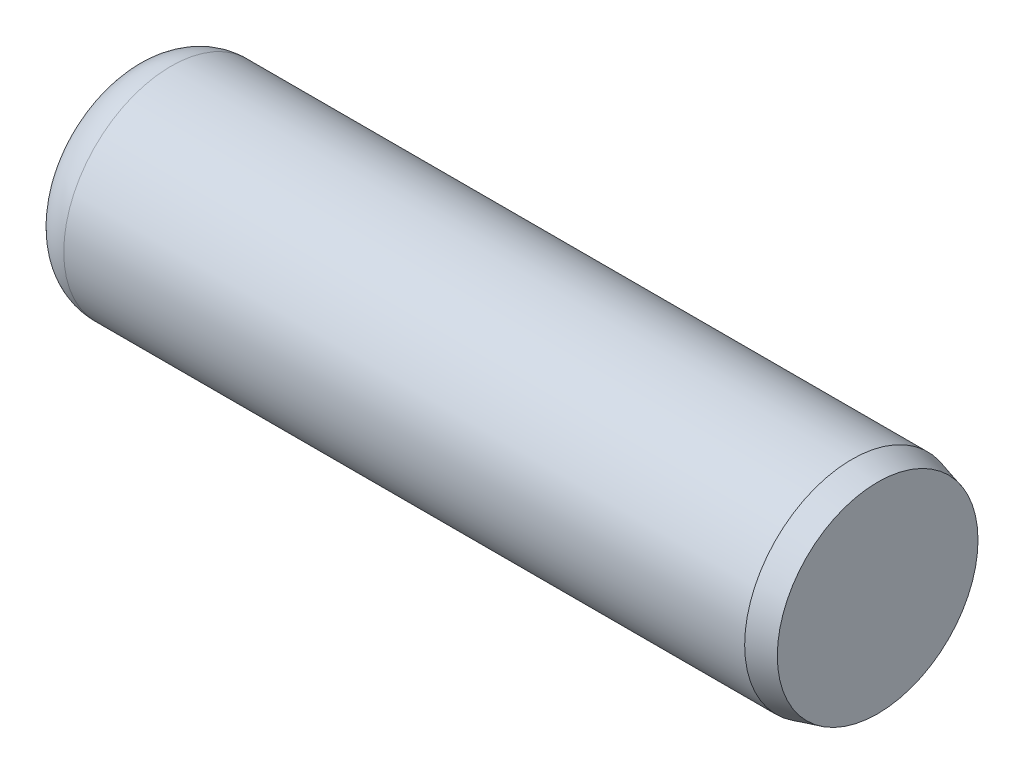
from build123d import *


with BuildPart() as part:
    # Sketch1 → Base-Revolve (revolve)
    with BuildSketch(Plane.XY, mode=Mode.PRIVATE) as base_revolve_sk:
        with BuildLine():
            Line((0, 0), (11.1125, 0))
            Line((11.1125, 0), (11.1125, 1.487788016))
            Line((11.1125, 1.487788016), (10.7308904, 1.59004))
            Line((10.7308904, 1.59004), (0.636016, 1.59004))
            ThreePointArc((0.636016, 1.59004), (0.186284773, 1.403755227), (0, 0.954024))
            Line((0, 0.954024), (0, 0))
        make_face()
    revolve(base_revolve_sk.sketch.rotate(Axis((-6.35, 0, 0), (1, 0, 0)), 90), axis=Axis((-6.35, 0, 0), (1, 0, 0)))


solid = part.part
